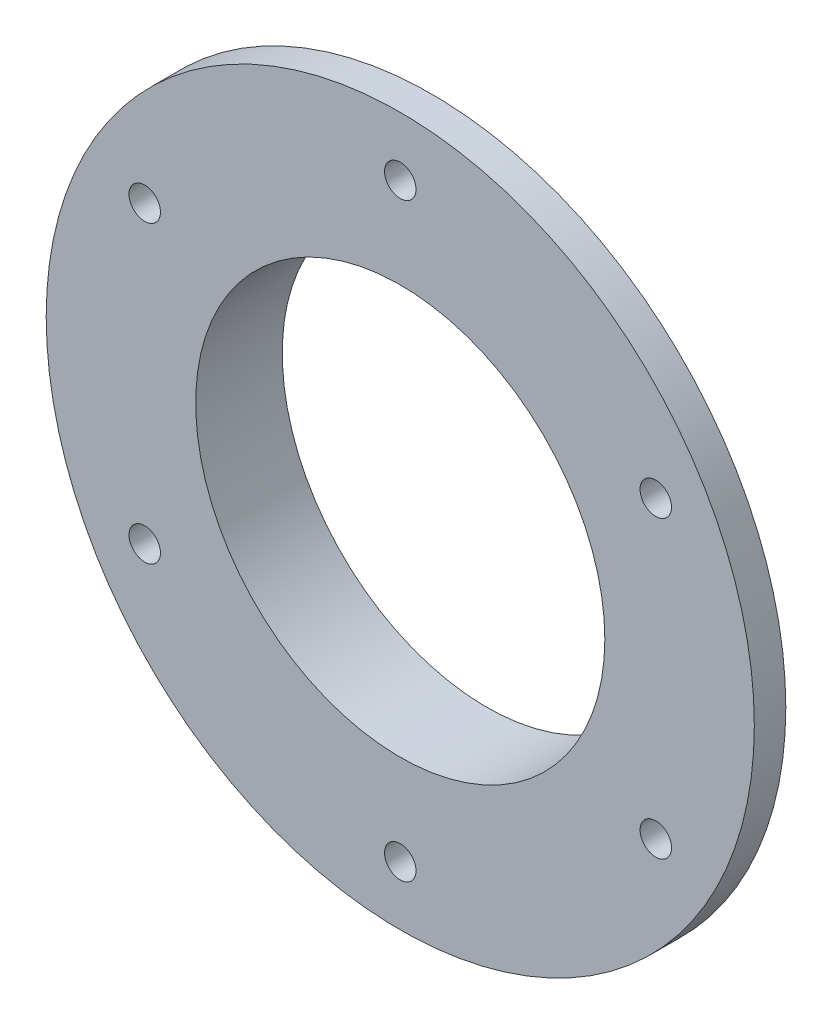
from build123d import *

# Parameters (mm, degrees)
SKETCH2_R          = 4
CUT_EXTRUDE1_DEPTH = 130.16655914
CIRPATTERN1_COUNT  = 6


with BuildPart() as part:
    # Sketch1 → Revolve1 (revolve)
    with BuildSketch(Plane(origin=(0, 0, 0), x_dir=(0, 0, -1), z_dir=(1, 0, 0)), mode=Mode.PRIVATE) as revolve1_sk:
        Polygon((0, 52), (0, 90), (8, 90), (8, 60), (22, 60), (22, 52), align=None)
    revolve(revolve1_sk.sketch.rotate(Axis((0, 0, 0), (0, 0, -1)), 90), axis=Axis((0, 0, 0), (0, 0, -1)))

    # Sketch2 → Cut-Extrude1 (cut, through all)
    with BuildSketch(Plane.XY):
        with Locations((0, 75)):
            Circle(SKETCH2_R)
    cut_extrude1 = extrude(amount=-CUT_EXTRUDE1_DEPTH, mode=Mode.SUBTRACT)

    # CirPattern1: Cut-Extrude1 ×6 about axis
    cirpattern1_axis = Axis((0, 0, 0), (0, 0, 1))
    for i in range(1, CIRPATTERN1_COUNT):
        add(cut_extrude1.rotate(cirpattern1_axis, i * 360 / CIRPATTERN1_COUNT), mode=Mode.SUBTRACT)


solid = part.part
